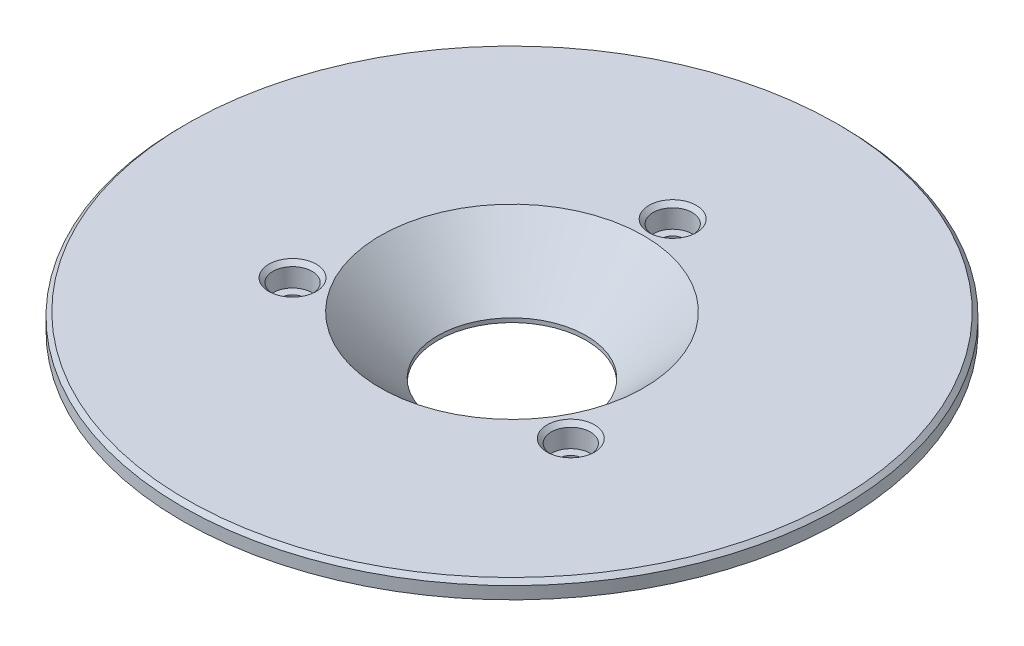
ISO-10303-21;
HEADER;
FILE_DESCRIPTION(('STEP AP214'),'2;1');
FILE_NAME('part.step','',(''),(''),'','','');
FILE_SCHEMA(('AUTOMOTIVE_DESIGN { 1 0 10303 214 1 1 1 1 }'));
ENDSEC;
DATA;
#1=APPLICATION_CONTEXT('core data for automotive mechanical design processes');
#2=APPLICATION_PROTOCOL_DEFINITION('international standard','automotive_design',2000,#1);
#3=PRODUCT_CONTEXT('',#1,'mechanical');
#4=PRODUCT('Part','Part','',(#3));
#5=PRODUCT_RELATED_PRODUCT_CATEGORY('part','',(#4));
#6=PRODUCT_DEFINITION_FORMATION('','',#4);
#7=PRODUCT_DEFINITION_CONTEXT('part definition',#1,'design');
#8=PRODUCT_DEFINITION('design','',#6,#7);
#9=PRODUCT_DEFINITION_SHAPE('','',#8);
#10=(LENGTH_UNIT() NAMED_UNIT(*) SI_UNIT(.MILLI.,.METRE.));
#11=(NAMED_UNIT(*) PLANE_ANGLE_UNIT() SI_UNIT($,.RADIAN.));
#12=(NAMED_UNIT(*) SI_UNIT($,.STERADIAN.) SOLID_ANGLE_UNIT());
#13=UNCERTAINTY_MEASURE_WITH_UNIT(LENGTH_MEASURE(1.E-05),#10,'distance_accuracy_value','');
#14=(GEOMETRIC_REPRESENTATION_CONTEXT(3) GLOBAL_UNCERTAINTY_ASSIGNED_CONTEXT((#13)) GLOBAL_UNIT_ASSIGNED_CONTEXT((#10,
#11,#12)) REPRESENTATION_CONTEXT('',''));
#15=CARTESIAN_POINT('',(0.,0.,0.));
#16=DIRECTION('',(0.,0.,1.));
#17=DIRECTION('',(1.,0.,0.));
#18=AXIS2_PLACEMENT_3D('',#15,#16,#17);
#19=CARTESIAN_POINT('',(-32.,15.,0.));
#20=DIRECTION('',(0.,-1.,0.));
#21=DIRECTION('',(0.,0.,-1.));
#22=AXIS2_PLACEMENT_3D('',#19,#20,#21);
#23=PLANE('',#22);
#24=CARTESIAN_POINT('',(33.7749907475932,15.,19.5));
#25=DIRECTION('',(0.,-1.,0.));
#26=DIRECTION('',(0.,0.,-1.));
#27=AXIS2_PLACEMENT_3D('',#24,#25,#26);
#28=CIRCLE('',#27,5.75);
#29=CARTESIAN_POINT('',(33.7749907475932,15.,13.75));
#30=VERTEX_POINT('',#29);
#31=EDGE_CURVE('E25',#30,#30,#28,.T.);
#32=ORIENTED_EDGE('',*,*,#31,.T.);
#33=EDGE_LOOP('',(#32));
#34=FACE_BOUND('',#33,.T.);
#35=CARTESIAN_POINT('',(0.,15.,-39.));
#36=DIRECTION('',(0.,-1.,0.));
#37=DIRECTION('',(0.,0.,-1.));
#38=AXIS2_PLACEMENT_3D('',#35,#36,#37);
#39=CIRCLE('',#38,5.75);
#40=CARTESIAN_POINT('',(0.,15.,-44.75));
#41=VERTEX_POINT('',#40);
#42=EDGE_CURVE('E29',#41,#41,#39,.T.);
#43=ORIENTED_EDGE('',*,*,#42,.T.);
#44=EDGE_LOOP('',(#43));
#45=FACE_BOUND('',#44,.T.);
#46=CARTESIAN_POINT('',(-33.7749907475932,15.,19.5));
#47=DIRECTION('',(0.,-1.,0.));
#48=DIRECTION('',(0.,0.,-1.));
#49=AXIS2_PLACEMENT_3D('',#46,#47,#48);
#50=CIRCLE('',#49,5.75);
#51=CARTESIAN_POINT('',(-33.7749907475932,15.,13.75));
#52=VERTEX_POINT('',#51);
#53=EDGE_CURVE('E34',#52,#52,#50,.T.);
#54=ORIENTED_EDGE('',*,*,#53,.T.);
#55=EDGE_LOOP('',(#54));
#56=FACE_BOUND('',#55,.T.);
#57=CARTESIAN_POINT('',(0.,15.,0.));
#58=DIRECTION('',(0.,-1.,0.));
#59=DIRECTION('',(0.,0.,-1.));
#60=AXIS2_PLACEMENT_3D('',#57,#58,#59);
#61=CIRCLE('',#60,79.);
#62=CARTESIAN_POINT('',(0.,15.,-79.));
#63=VERTEX_POINT('',#62);
#64=EDGE_CURVE('E58',#63,#63,#61,.F.);
#65=ORIENTED_EDGE('',*,*,#64,.T.);
#66=EDGE_LOOP('',(#65));
#67=FACE_BOUND('',#66,.T.);
#68=CARTESIAN_POINT('',(0.,15.,0.));
#69=DIRECTION('',(0.,-1.,0.));
#70=DIRECTION('',(0.,0.,-1.));
#71=AXIS2_PLACEMENT_3D('',#68,#69,#70);
#72=CIRCLE('',#71,32.);
#73=CARTESIAN_POINT('',(0.,15.,-32.));
#74=VERTEX_POINT('',#73);
#75=EDGE_CURVE('E70',#74,#74,#72,.T.);
#76=ORIENTED_EDGE('',*,*,#75,.T.);
#77=EDGE_LOOP('',(#76));
#78=FACE_BOUND('',#77,.T.);
#79=ADVANCED_FACE('F14',(#34,#45,#56,#67,#78),#23,.F.);
#80=CARTESIAN_POINT('',(0.,1.,0.));
#81=DIRECTION('',(0.,1.,0.));
#82=DIRECTION('',(0.,0.,1.));
#83=AXIS2_PLACEMENT_3D('',#80,#81,#82);
#84=CONICAL_SURFACE('',#83,18.,0.78539816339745);
#85=ORIENTED_EDGE('',*,*,#75,.F.);
#86=EDGE_LOOP('',(#85));
#87=FACE_BOUND('',#86,.T.);
#88=CARTESIAN_POINT('',(0.,1.,0.));
#89=DIRECTION('',(0.,-1.,0.));
#90=DIRECTION('',(0.,0.,-1.));
#91=AXIS2_PLACEMENT_3D('',#88,#89,#90);
#92=CIRCLE('',#91,18.);
#93=CARTESIAN_POINT('',(0.,1.,-18.));
#94=VERTEX_POINT('',#93);
#95=EDGE_CURVE('E83',#94,#94,#92,.T.);
#96=ORIENTED_EDGE('',*,*,#95,.T.);
#97=EDGE_LOOP('',(#96));
#98=FACE_BOUND('',#97,.T.);
#99=ADVANCED_FACE('F123',(#87,#98),#84,.F.);
#100=CARTESIAN_POINT('',(0.,0.,0.));
#101=DIRECTION('',(0.,-1.,0.));
#102=DIRECTION('',(0.,0.,-1.));
#103=AXIS2_PLACEMENT_3D('',#100,#101,#102);
#104=CYLINDRICAL_SURFACE('',#103,18.);
#105=ORIENTED_EDGE('',*,*,#95,.F.);
#106=EDGE_LOOP('',(#105));
#107=FACE_BOUND('',#106,.T.);
#108=CARTESIAN_POINT('',(0.,0.,0.));
#109=DIRECTION('',(0.,-1.,0.));
#110=DIRECTION('',(0.,0.,-1.));
#111=AXIS2_PLACEMENT_3D('',#108,#109,#110);
#112=CIRCLE('',#111,18.);
#113=CARTESIAN_POINT('',(0.,0.,-18.));
#114=VERTEX_POINT('',#113);
#115=EDGE_CURVE('E86',#114,#114,#112,.T.);
#116=ORIENTED_EDGE('',*,*,#115,.T.);
#117=EDGE_LOOP('',(#116));
#118=FACE_BOUND('',#117,.T.);
#119=ADVANCED_FACE('F130',(#107,#118),#104,.F.);
#120=CARTESIAN_POINT('',(-18.,0.,0.));
#121=DIRECTION('',(0.,1.,0.));
#122=DIRECTION('',(0.,0.,1.));
#123=AXIS2_PLACEMENT_3D('',#120,#121,#122);
#124=PLANE('',#123);
#125=CARTESIAN_POINT('',(-33.7749907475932,0.,19.5));
#126=DIRECTION('',(0.,1.,0.));
#127=DIRECTION('',(0.,0.,1.));
#128=AXIS2_PLACEMENT_3D('',#125,#126,#127);
#129=CIRCLE('',#128,3.75);
#130=CARTESIAN_POINT('',(-33.7749907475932,0.,23.25));
#131=VERTEX_POINT('',#130);
#132=EDGE_CURVE('E49',#131,#131,#129,.T.);
#133=ORIENTED_EDGE('',*,*,#132,.T.);
#134=EDGE_LOOP('',(#133));
#135=FACE_BOUND('',#134,.T.);
#136=CARTESIAN_POINT('',(33.7749907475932,0.,19.5));
#137=DIRECTION('',(0.,1.,0.));
#138=DIRECTION('',(0.,0.,1.));
#139=AXIS2_PLACEMENT_3D('',#136,#137,#138);
#140=CIRCLE('',#139,3.75);
#141=CARTESIAN_POINT('',(33.7749907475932,0.,23.25));
#142=VERTEX_POINT('',#141);
#143=EDGE_CURVE('E52',#142,#142,#140,.T.);
#144=ORIENTED_EDGE('',*,*,#143,.T.);
#145=EDGE_LOOP('',(#144));
#146=FACE_BOUND('',#145,.T.);
#147=CARTESIAN_POINT('',(0.,0.,-39.));
#148=DIRECTION('',(0.,1.,0.));
#149=DIRECTION('',(0.,0.,1.));
#150=AXIS2_PLACEMENT_3D('',#147,#148,#149);
#151=CIRCLE('',#150,3.75);
#152=CARTESIAN_POINT('',(0.,0.,-35.25));
#153=VERTEX_POINT('',#152);
#154=EDGE_CURVE('E55',#153,#153,#151,.T.);
#155=ORIENTED_EDGE('',*,*,#154,.T.);
#156=EDGE_LOOP('',(#155));
#157=FACE_BOUND('',#156,.T.);
#158=CARTESIAN_POINT('',(0.,0.,0.));
#159=DIRECTION('',(0.,1.,0.));
#160=DIRECTION('',(0.,0.,1.));
#161=AXIS2_PLACEMENT_3D('',#158,#159,#160);
#162=CIRCLE('',#161,44.);
#163=CARTESIAN_POINT('',(0.,0.,44.));
#164=VERTEX_POINT('',#163);
#165=EDGE_CURVE('E67',#164,#164,#162,.F.);
#166=ORIENTED_EDGE('',*,*,#165,.T.);
#167=EDGE_LOOP('',(#166));
#168=FACE_BOUND('',#167,.T.);
#169=ORIENTED_EDGE('',*,*,#115,.F.);
#170=EDGE_LOOP('',(#169));
#171=FACE_BOUND('',#170,.T.);
#172=ADVANCED_FACE('F181',(#135,#146,#157,#168,#171),#124,.F.);
#173=CARTESIAN_POINT('',(0.,0.,0.));
#174=DIRECTION('',(0.,-1.,0.));
#175=DIRECTION('',(0.,0.,-1.));
#176=AXIS2_PLACEMENT_3D('',#173,#174,#175);
#177=CYLINDRICAL_SURFACE('',#176,45.);
#178=CARTESIAN_POINT('',(0.,0.999999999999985,0.));
#179=DIRECTION('',(0.,1.,0.));
#180=DIRECTION('',(0.,0.,1.));
#181=AXIS2_PLACEMENT_3D('',#178,#179,#180);
#182=CIRCLE('',#181,45.);
#183=CARTESIAN_POINT('',(0.,0.999999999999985,45.));
#184=VERTEX_POINT('',#183);
#185=EDGE_CURVE('E64',#184,#184,#182,.T.);
#186=ORIENTED_EDGE('',*,*,#185,.T.);
#187=EDGE_LOOP('',(#186));
#188=FACE_BOUND('',#187,.T.);
#189=CARTESIAN_POINT('',(0.,11.,0.));
#190=DIRECTION('',(0.,-1.,0.));
#191=DIRECTION('',(0.,0.,-1.));
#192=AXIS2_PLACEMENT_3D('',#189,#190,#191);
#193=CIRCLE('',#192,45.);
#194=CARTESIAN_POINT('',(0.,11.,-45.));
#195=VERTEX_POINT('',#194);
#196=EDGE_CURVE('E89',#195,#195,#193,.T.);
#197=ORIENTED_EDGE('',*,*,#196,.T.);
#198=EDGE_LOOP('',(#197));
#199=FACE_BOUND('',#198,.T.);
#200=ADVANCED_FACE('F185',(#188,#199),#177,.T.);
#201=CARTESIAN_POINT('',(-45.,11.,0.));
#202=DIRECTION('',(0.,1.,0.));
#203=DIRECTION('',(0.,0.,1.));
#204=AXIS2_PLACEMENT_3D('',#201,#202,#203);
#205=PLANE('',#204);
#206=ORIENTED_EDGE('',*,*,#196,.F.);
#207=EDGE_LOOP('',(#206));
#208=FACE_BOUND('',#207,.T.);
#209=CARTESIAN_POINT('',(0.,11.,0.));
#210=DIRECTION('',(0.,-1.,0.));
#211=DIRECTION('',(0.,0.,-1.));
#212=AXIS2_PLACEMENT_3D('',#209,#210,#211);
#213=CIRCLE('',#212,80.);
#214=CARTESIAN_POINT('',(0.,11.,-80.));
#215=VERTEX_POINT('',#214);
#216=EDGE_CURVE('E92',#215,#215,#213,.T.);
#217=ORIENTED_EDGE('',*,*,#216,.T.);
#218=EDGE_LOOP('',(#217));
#219=FACE_BOUND('',#218,.T.);
#220=ADVANCED_FACE('F192',(#208,#219),#205,.F.);
#221=CARTESIAN_POINT('',(0.,0.,0.));
#222=DIRECTION('',(0.,-1.,0.));
#223=DIRECTION('',(0.,0.,-1.));
#224=AXIS2_PLACEMENT_3D('',#221,#222,#223);
#225=CYLINDRICAL_SURFACE('',#224,80.);
#226=CARTESIAN_POINT('',(0.,14.,0.));
#227=DIRECTION('',(0.,-1.,0.));
#228=DIRECTION('',(0.,0.,-1.));
#229=AXIS2_PLACEMENT_3D('',#226,#227,#228);
#230=CIRCLE('',#229,80.);
#231=CARTESIAN_POINT('',(0.,14.,-80.));
#232=VERTEX_POINT('',#231);
#233=EDGE_CURVE('E61',#232,#232,#230,.T.);
#234=ORIENTED_EDGE('',*,*,#233,.T.);
#235=EDGE_LOOP('',(#234));
#236=FACE_BOUND('',#235,.T.);
#237=ORIENTED_EDGE('',*,*,#216,.F.);
#238=EDGE_LOOP('',(#237));
#239=FACE_BOUND('',#238,.T.);
#240=ADVANCED_FACE('F199',(#236,#239),#225,.T.);
#241=CARTESIAN_POINT('',(33.7749907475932,9.5,19.5));
#242=DIRECTION('',(0.,1.,0.));
#243=DIRECTION('',(0.,0.,1.));
#244=AXIS2_PLACEMENT_3D('',#241,#242,#243);
#245=CYLINDRICAL_SURFACE('',#244,4.75);
#246=CARTESIAN_POINT('',(33.7749907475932,14.,19.5));
#247=DIRECTION('',(0.,-1.,0.));
#248=DIRECTION('',(0.,0.,-1.));
#249=AXIS2_PLACEMENT_3D('',#246,#247,#248);
#250=CIRCLE('',#249,4.75);
#251=CARTESIAN_POINT('',(33.7749907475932,14.,14.75));
#252=VERTEX_POINT('',#251);
#253=EDGE_CURVE('E37',#252,#252,#250,.F.);
#254=ORIENTED_EDGE('',*,*,#253,.T.);
#255=EDGE_LOOP('',(#254));
#256=FACE_BOUND('',#255,.T.);
#257=CARTESIAN_POINT('',(33.7749907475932,9.5,19.5));
#258=DIRECTION('',(0.,1.,0.));
#259=DIRECTION('',(0.,0.,-1.));
#260=AXIS2_PLACEMENT_3D('',#257,#258,#259);
#261=CIRCLE('',#260,4.75);
#262=CARTESIAN_POINT('',(33.7749907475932,9.5,14.75));
#263=VERTEX_POINT('',#262);
#264=EDGE_CURVE('E74',#263,#263,#261,.T.);
#265=ORIENTED_EDGE('',*,*,#264,.F.);
#266=EDGE_LOOP('',(#265));
#267=FACE_BOUND('',#266,.T.);
#268=ADVANCED_FACE('F203',(#256,#267),#245,.F.);
#269=CARTESIAN_POINT('',(33.7749907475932,9.5,19.5));
#270=DIRECTION('',(0.,-1.,0.));
#271=DIRECTION('',(0.,0.,-1.));
#272=AXIS2_PLACEMENT_3D('',#269,#270,#271);
#273=PLANE('',#272);
#274=CARTESIAN_POINT('',(33.7749907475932,9.5,19.5));
#275=DIRECTION('',(0.,-1.,0.));
#276=DIRECTION('',(0.,0.,-1.));
#277=AXIS2_PLACEMENT_3D('',#274,#275,#276);
#278=CIRCLE('',#277,2.75);
#279=CARTESIAN_POINT('',(33.7749907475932,9.5,16.75));
#280=VERTEX_POINT('',#279);
#281=EDGE_CURVE('E71',#280,#280,#278,.T.);
#282=ORIENTED_EDGE('',*,*,#281,.T.);
#283=EDGE_LOOP('',(#282));
#284=FACE_BOUND('',#283,.T.);
#285=ORIENTED_EDGE('',*,*,#264,.T.);
#286=EDGE_LOOP('',(#285));
#287=FACE_BOUND('',#286,.T.);
#288=ADVANCED_FACE('F207',(#284,#287),#273,.F.);
#289=CARTESIAN_POINT('',(-33.7749907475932,9.5,19.5));
#290=DIRECTION('',(0.,1.,0.));
#291=DIRECTION('',(0.,0.,1.));
#292=AXIS2_PLACEMENT_3D('',#289,#290,#291);
#293=CYLINDRICAL_SURFACE('',#292,4.75);
#294=CARTESIAN_POINT('',(-33.7749907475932,14.,19.5));
#295=DIRECTION('',(0.,-1.,0.));
#296=DIRECTION('',(0.,0.,-1.));
#297=AXIS2_PLACEMENT_3D('',#294,#295,#296);
#298=CIRCLE('',#297,4.75);
#299=CARTESIAN_POINT('',(-33.7749907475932,14.,14.75));
#300=VERTEX_POINT('',#299);
#301=EDGE_CURVE('E9',#300,#300,#298,.F.);
#302=ORIENTED_EDGE('',*,*,#301,.T.);
#303=EDGE_LOOP('',(#302));
#304=FACE_BOUND('',#303,.T.);
#305=CARTESIAN_POINT('',(-33.7749907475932,9.5,19.5));
#306=DIRECTION('',(0.,1.,0.));
#307=DIRECTION('',(0.,0.,1.));
#308=AXIS2_PLACEMENT_3D('',#305,#306,#307);
#309=CIRCLE('',#308,4.75);
#310=CARTESIAN_POINT('',(-33.7749907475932,9.5,24.25));
#311=VERTEX_POINT('',#310);
#312=EDGE_CURVE('E98',#311,#311,#309,.T.);
#313=ORIENTED_EDGE('',*,*,#312,.F.);
#314=EDGE_LOOP('',(#313));
#315=FACE_BOUND('',#314,.T.);
#316=ADVANCED_FACE('F119',(#304,#315),#293,.F.);
#317=CARTESIAN_POINT('',(-33.7749907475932,9.5,19.5));
#318=DIRECTION('',(0.,1.,0.));
#319=DIRECTION('',(0.,0.,1.));
#320=AXIS2_PLACEMENT_3D('',#317,#318,#319);
#321=PLANE('',#320);
#322=CARTESIAN_POINT('',(-33.7749907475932,9.5,19.5));
#323=DIRECTION('',(0.,1.,0.));
#324=DIRECTION('',(0.,0.,1.));
#325=AXIS2_PLACEMENT_3D('',#322,#323,#324);
#326=CIRCLE('',#325,2.75);
#327=CARTESIAN_POINT('',(-33.7749907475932,9.5,22.25));
#328=VERTEX_POINT('',#327);
#329=EDGE_CURVE('E75',#328,#328,#326,.T.);
#330=ORIENTED_EDGE('',*,*,#329,.F.);
#331=EDGE_LOOP('',(#330));
#332=FACE_BOUND('',#331,.T.);
#333=ORIENTED_EDGE('',*,*,#312,.T.);
#334=EDGE_LOOP('',(#333));
#335=FACE_BOUND('',#334,.T.);
#336=ADVANCED_FACE('F108',(#332,#335),#321,.T.);
#337=CARTESIAN_POINT('',(0.,9.5,-39.));
#338=DIRECTION('',(0.,1.,0.));
#339=DIRECTION('',(0.,0.,1.));
#340=AXIS2_PLACEMENT_3D('',#337,#338,#339);
#341=CYLINDRICAL_SURFACE('',#340,4.75);
#342=CARTESIAN_POINT('',(0.,14.,-39.));
#343=DIRECTION('',(0.,-1.,0.));
#344=DIRECTION('',(0.,0.,-1.));
#345=AXIS2_PLACEMENT_3D('',#342,#343,#344);
#346=CIRCLE('',#345,4.75);
#347=CARTESIAN_POINT('',(0.,14.,-43.75));
#348=VERTEX_POINT('',#347);
#349=EDGE_CURVE('E21',#348,#348,#346,.F.);
#350=ORIENTED_EDGE('',*,*,#349,.T.);
#351=EDGE_LOOP('',(#350));
#352=FACE_BOUND('',#351,.T.);
#353=CARTESIAN_POINT('',(0.,9.5,-39.));
#354=DIRECTION('',(0.,1.,0.));
#355=DIRECTION('',(0.,0.,1.));
#356=AXIS2_PLACEMENT_3D('',#353,#354,#355);
#357=CIRCLE('',#356,4.75);
#358=CARTESIAN_POINT('',(0.,9.5,-34.25));
#359=VERTEX_POINT('',#358);
#360=EDGE_CURVE('E95',#359,#359,#357,.T.);
#361=ORIENTED_EDGE('',*,*,#360,.F.);
#362=EDGE_LOOP('',(#361));
#363=FACE_BOUND('',#362,.T.);
#364=ADVANCED_FACE('F106',(#352,#363),#341,.F.);
#365=CARTESIAN_POINT('',(0.,9.5,-39.));
#366=DIRECTION('',(0.,1.,0.));
#367=DIRECTION('',(0.,0.,1.));
#368=AXIS2_PLACEMENT_3D('',#365,#366,#367);
#369=PLANE('',#368);
#370=CARTESIAN_POINT('',(0.,9.5,-39.));
#371=DIRECTION('',(0.,1.,0.));
#372=DIRECTION('',(0.,0.,1.));
#373=AXIS2_PLACEMENT_3D('',#370,#371,#372);
#374=CIRCLE('',#373,2.75);
#375=CARTESIAN_POINT('',(0.,9.5,-36.25));
#376=VERTEX_POINT('',#375);
#377=EDGE_CURVE('E78',#376,#376,#374,.T.);
#378=ORIENTED_EDGE('',*,*,#377,.F.);
#379=EDGE_LOOP('',(#378));
#380=FACE_BOUND('',#379,.T.);
#381=ORIENTED_EDGE('',*,*,#360,.T.);
#382=EDGE_LOOP('',(#381));
#383=FACE_BOUND('',#382,.T.);
#384=ADVANCED_FACE('F104',(#380,#383),#369,.T.);
#385=CARTESIAN_POINT('',(0.,0.,-39.));
#386=DIRECTION('',(0.,1.,0.));
#387=DIRECTION('',(0.,0.,1.));
#388=AXIS2_PLACEMENT_3D('',#385,#386,#387);
#389=CYLINDRICAL_SURFACE('',#388,2.75);
#390=CARTESIAN_POINT('',(0.,1.,-39.));
#391=DIRECTION('',(0.,1.,0.));
#392=DIRECTION('',(0.,0.,1.));
#393=AXIS2_PLACEMENT_3D('',#390,#391,#392);
#394=CIRCLE('',#393,2.75);
#395=CARTESIAN_POINT('',(0.,1.,-36.25));
#396=VERTEX_POINT('',#395);
#397=EDGE_CURVE('E40',#396,#396,#394,.F.);
#398=ORIENTED_EDGE('',*,*,#397,.T.);
#399=EDGE_LOOP('',(#398));
#400=FACE_BOUND('',#399,.T.);
#401=ORIENTED_EDGE('',*,*,#377,.T.);
#402=EDGE_LOOP('',(#401));
#403=FACE_BOUND('',#402,.T.);
#404=ADVANCED_FACE('F116',(#400,#403),#389,.F.);
#405=CARTESIAN_POINT('',(-33.7749907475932,0.,19.5));
#406=DIRECTION('',(0.,1.,0.));
#407=DIRECTION('',(0.,0.,1.));
#408=AXIS2_PLACEMENT_3D('',#405,#406,#407);
#409=CYLINDRICAL_SURFACE('',#408,2.75);
#410=CARTESIAN_POINT('',(-33.7749907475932,1.00000000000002,19.5));
#411=DIRECTION('',(0.,1.,0.));
#412=DIRECTION('',(0.,0.,1.));
#413=AXIS2_PLACEMENT_3D('',#410,#411,#412);
#414=CIRCLE('',#413,2.75);
#415=CARTESIAN_POINT('',(-33.7749907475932,1.00000000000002,22.25));
#416=VERTEX_POINT('',#415);
#417=EDGE_CURVE('E46',#416,#416,#414,.F.);
#418=ORIENTED_EDGE('',*,*,#417,.T.);
#419=EDGE_LOOP('',(#418));
#420=FACE_BOUND('',#419,.T.);
#421=ORIENTED_EDGE('',*,*,#329,.T.);
#422=EDGE_LOOP('',(#421));
#423=FACE_BOUND('',#422,.T.);
#424=ADVANCED_FACE('F338',(#420,#423),#409,.F.);
#425=CARTESIAN_POINT('',(33.7749907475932,0.,19.5));
#426=DIRECTION('',(0.,1.,0.));
#427=DIRECTION('',(0.,0.,1.));
#428=AXIS2_PLACEMENT_3D('',#425,#426,#427);
#429=CYLINDRICAL_SURFACE('',#428,2.75);
#430=CARTESIAN_POINT('',(33.7749907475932,1.00000000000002,19.5));
#431=DIRECTION('',(0.,1.,0.));
#432=DIRECTION('',(0.,0.,1.));
#433=AXIS2_PLACEMENT_3D('',#430,#431,#432);
#434=CIRCLE('',#433,2.75);
#435=CARTESIAN_POINT('',(33.7749907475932,1.00000000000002,22.25));
#436=VERTEX_POINT('',#435);
#437=EDGE_CURVE('E43',#436,#436,#434,.F.);
#438=ORIENTED_EDGE('',*,*,#437,.T.);
#439=EDGE_LOOP('',(#438));
#440=FACE_BOUND('',#439,.T.);
#441=ORIENTED_EDGE('',*,*,#281,.F.);
#442=EDGE_LOOP('',(#441));
#443=FACE_BOUND('',#442,.T.);
#444=ADVANCED_FACE('F140',(#440,#443),#429,.F.);
#445=CARTESIAN_POINT('',(0.,0.,0.));
#446=DIRECTION('',(0.,1.,0.));
#447=DIRECTION('',(0.,0.,1.));
#448=AXIS2_PLACEMENT_3D('',#445,#446,#447);
#449=CONICAL_SURFACE('',#448,44.,0.785398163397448);
#450=ORIENTED_EDGE('',*,*,#185,.F.);
#451=EDGE_LOOP('',(#450));
#452=FACE_BOUND('',#451,.T.);
#453=ORIENTED_EDGE('',*,*,#165,.F.);
#454=EDGE_LOOP('',(#453));
#455=FACE_BOUND('',#454,.T.);
#456=ADVANCED_FACE('F136',(#452,#455),#449,.T.);
#457=CARTESIAN_POINT('',(0.,14.,0.));
#458=DIRECTION('',(0.,-1.,0.));
#459=DIRECTION('',(0.,0.,-1.));
#460=AXIS2_PLACEMENT_3D('',#457,#458,#459);
#461=CONICAL_SURFACE('',#460,80.,0.785398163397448);
#462=ORIENTED_EDGE('',*,*,#64,.F.);
#463=EDGE_LOOP('',(#462));
#464=FACE_BOUND('',#463,.T.);
#465=ORIENTED_EDGE('',*,*,#233,.F.);
#466=EDGE_LOOP('',(#465));
#467=FACE_BOUND('',#466,.T.);
#468=ADVANCED_FACE('F139',(#464,#467),#461,.T.);
#469=CARTESIAN_POINT('',(-33.7749907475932,0.,19.5));
#470=DIRECTION('',(0.,-1.,0.));
#471=DIRECTION('',(0.,0.,-1.));
#472=AXIS2_PLACEMENT_3D('',#469,#470,#471);
#473=CONICAL_SURFACE('',#472,3.75,0.785398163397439);
#474=ORIENTED_EDGE('',*,*,#417,.F.);
#475=EDGE_LOOP('',(#474));
#476=FACE_BOUND('',#475,.T.);
#477=ORIENTED_EDGE('',*,*,#132,.F.);
#478=EDGE_LOOP('',(#477));
#479=FACE_BOUND('',#478,.T.);
#480=ADVANCED_FACE('F144',(#476,#479),#473,.F.);
#481=CARTESIAN_POINT('',(33.7749907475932,0.,19.5));
#482=DIRECTION('',(0.,-1.,0.));
#483=DIRECTION('',(0.,0.,-1.));
#484=AXIS2_PLACEMENT_3D('',#481,#482,#483);
#485=CONICAL_SURFACE('',#484,3.75,0.785398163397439);
#486=ORIENTED_EDGE('',*,*,#437,.F.);
#487=EDGE_LOOP('',(#486));
#488=FACE_BOUND('',#487,.T.);
#489=ORIENTED_EDGE('',*,*,#143,.F.);
#490=EDGE_LOOP('',(#489));
#491=FACE_BOUND('',#490,.T.);
#492=ADVANCED_FACE('F148',(#488,#491),#485,.F.);
#493=CARTESIAN_POINT('',(0.,0.,-39.));
#494=DIRECTION('',(0.,-1.,0.));
#495=DIRECTION('',(0.,0.,-1.));
#496=AXIS2_PLACEMENT_3D('',#493,#494,#495);
#497=CONICAL_SURFACE('',#496,3.75,0.785398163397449);
#498=ORIENTED_EDGE('',*,*,#397,.F.);
#499=EDGE_LOOP('',(#498));
#500=FACE_BOUND('',#499,.T.);
#501=ORIENTED_EDGE('',*,*,#154,.F.);
#502=EDGE_LOOP('',(#501));
#503=FACE_BOUND('',#502,.T.);
#504=ADVANCED_FACE('F152',(#500,#503),#497,.F.);
#505=CARTESIAN_POINT('',(33.7749907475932,14.,19.5));
#506=DIRECTION('',(0.,1.,0.));
#507=DIRECTION('',(0.,0.,1.));
#508=AXIS2_PLACEMENT_3D('',#505,#506,#507);
#509=CONICAL_SURFACE('',#508,4.75,0.785398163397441);
#510=ORIENTED_EDGE('',*,*,#31,.F.);
#511=EDGE_LOOP('',(#510));
#512=FACE_BOUND('',#511,.T.);
#513=ORIENTED_EDGE('',*,*,#253,.F.);
#514=EDGE_LOOP('',(#513));
#515=FACE_BOUND('',#514,.T.);
#516=ADVANCED_FACE('F156',(#512,#515),#509,.F.);
#517=CARTESIAN_POINT('',(0.,14.,-39.));
#518=DIRECTION('',(0.,1.,0.));
#519=DIRECTION('',(0.,0.,1.));
#520=AXIS2_PLACEMENT_3D('',#517,#518,#519);
#521=CONICAL_SURFACE('',#520,4.75,0.785398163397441);
#522=ORIENTED_EDGE('',*,*,#42,.F.);
#523=EDGE_LOOP('',(#522));
#524=FACE_BOUND('',#523,.T.);
#525=ORIENTED_EDGE('',*,*,#349,.F.);
#526=EDGE_LOOP('',(#525));
#527=FACE_BOUND('',#526,.T.);
#528=ADVANCED_FACE('F159',(#524,#527),#521,.F.);
#529=CARTESIAN_POINT('',(-33.7749907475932,14.,19.5));
#530=DIRECTION('',(0.,1.,0.));
#531=DIRECTION('',(0.,0.,1.));
#532=AXIS2_PLACEMENT_3D('',#529,#530,#531);
#533=CONICAL_SURFACE('',#532,4.75,0.785398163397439);
#534=ORIENTED_EDGE('',*,*,#53,.F.);
#535=EDGE_LOOP('',(#534));
#536=FACE_BOUND('',#535,.T.);
#537=ORIENTED_EDGE('',*,*,#301,.F.);
#538=EDGE_LOOP('',(#537));
#539=FACE_BOUND('',#538,.T.);
#540=ADVANCED_FACE('F16',(#536,#539),#533,.F.);
#541=CLOSED_SHELL('',(#79,#99,#119,#172,#200,#220,#240,#268,#288,#316,#336,#364,#384,#404,#424,
#444,#456,#468,#480,#492,#504,#516,#528,#540));
#542=MANIFOLD_SOLID_BREP('B1',#541);
#543=ADVANCED_BREP_SHAPE_REPRESENTATION('',(#18,#542),#14);
#544=SHAPE_DEFINITION_REPRESENTATION(#9,#543);
ENDSEC;
END-ISO-10303-21;
